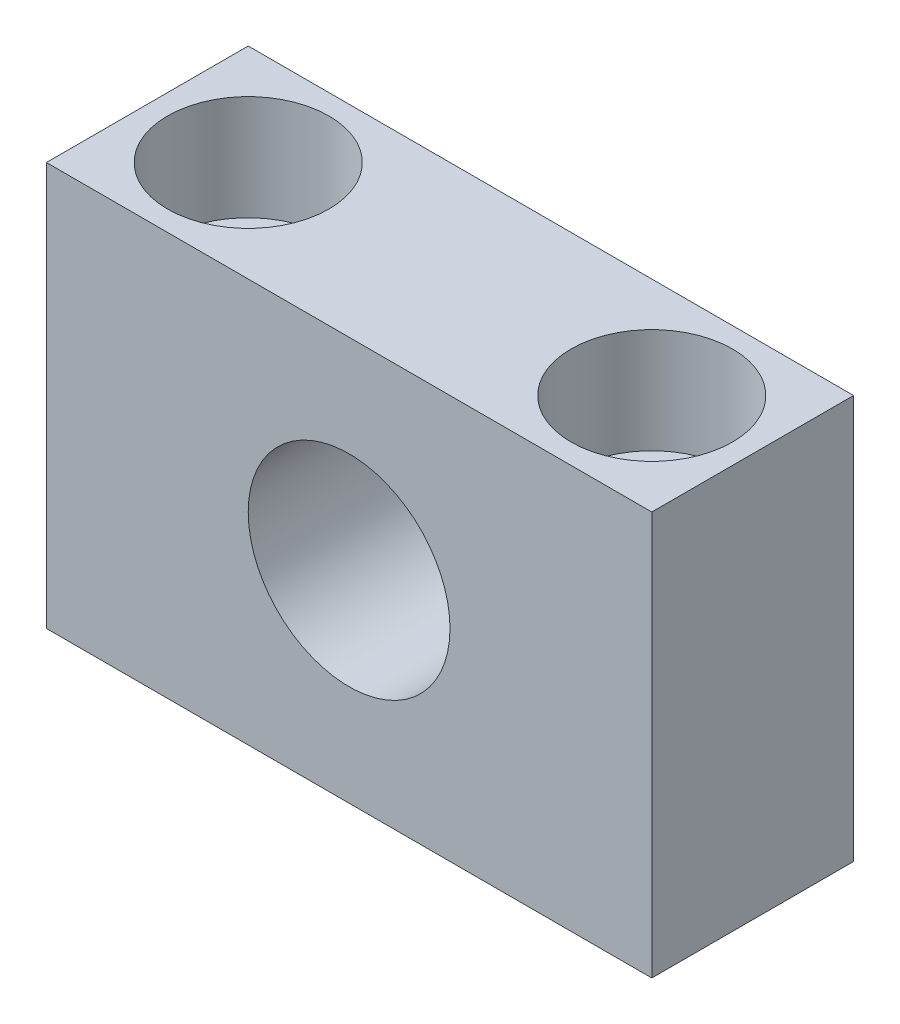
from build123d import *

# Parameters (mm, degrees)
SKETCH_1_W                                          = 130
SKETCH_1_H                                          = 50
SKETCH_1_R                                          = 12.5
EXTRUDE_1_DEPTH                                     = 25
CBORE_FOR_M12_HEX_SOCKET_HEAD_CAP_SCREW_D           = 13.5
CBORE_FOR_M12_HEX_SOCKET_HEAD_CAP_SCREW_CBORE_D     = 20
CBORE_FOR_M12_HEX_SOCKET_HEAD_CAP_SCREW_CBORE_DEPTH = 13
SKETCH_5_OUTSIDE_W                                  = 160.302
SKETCH_5_OUTSIDE_H                                  = 80.302
SKETCH_5_OUTSIDE_W_2                                = 75
SKETCH_5_OUTSIDE_H_2                                = 50
CUT_EXTRUDE_1_DEPTH                                 = 25


with BuildPart() as part:
    # Sketch 1 → Extrude 1 (new body)
    with BuildSketch(Plane.XY):
        Rectangle(SKETCH_1_W, SKETCH_1_H)
        Circle(SKETCH_1_R, mode=Mode.SUBTRACT)
    extrude(amount=EXTRUDE_1_DEPTH)

    # CBORE for M12 Hex Socket Head Cap Screw (through all)
    with Locations(Plane(origin=(0, 25, 0), x_dir=(1, 0, 0), z_dir=(0, 1, 0))):
        with Locations((-50, -12.5), (-25, -12.5), (25, -12.5), (50, -12.5)):
            CounterBoreHole(CBORE_FOR_M12_HEX_SOCKET_HEAD_CAP_SCREW_D / 2, CBORE_FOR_M12_HEX_SOCKET_HEAD_CAP_SCREW_CBORE_D / 2, CBORE_FOR_M12_HEX_SOCKET_HEAD_CAP_SCREW_CBORE_DEPTH)

    # Sketch 5 outside → Cut-Extrude 1 (cut)
    with BuildSketch(Plane.XY):
        Rectangle(SKETCH_5_OUTSIDE_W, SKETCH_5_OUTSIDE_H)
        Rectangle(SKETCH_5_OUTSIDE_W_2, SKETCH_5_OUTSIDE_H_2, mode=Mode.SUBTRACT)
    extrude(amount=CUT_EXTRUDE_1_DEPTH, mode=Mode.SUBTRACT)


solid = part.part
